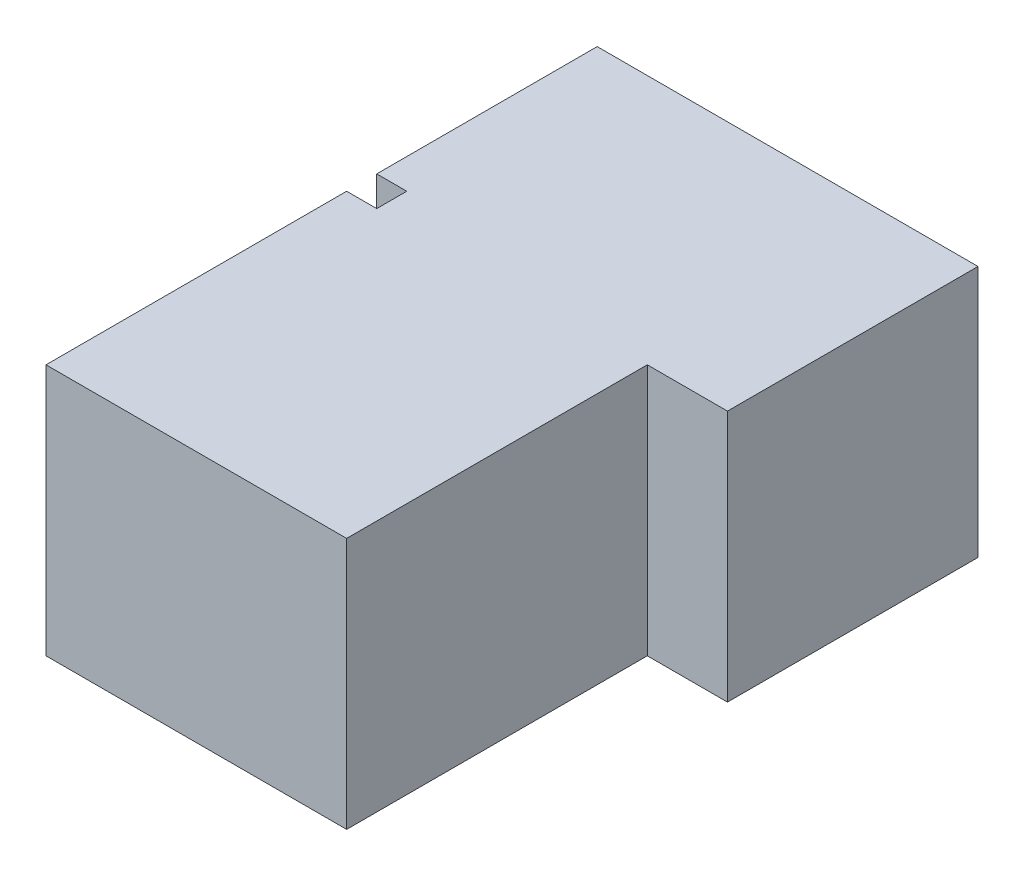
from build123d import *

# Parameters (mm, degrees)
BOSS_EXTRUDE1_DEPTH  = 10
BOSS_EXTRUDE2_DEPTH  = 2500
SKETCH5_W            = 820
SKETCH5_H            = 400
SKETCH5_W_2          = 1110
BOSS_EXTRUDE3_DEPTH  = 400
SKETCH7_W            = 450
SKETCH7_H            = 500
BOSS_EXTRUDE4_DEPTH  = 600
BOSS_EXTRUDE5_DEPTH  = 800
SKETCH8_W            = 600
SKETCH8_H            = 500
CUT_EXTRUDE1_DEPTH   = 600
SKETCH9_W            = 602.400982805
SKETCH9_H            = 23.017507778
BOSS_EXTRUDE6_DEPTH  = 200
SKETCH10_W           = 746.896882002
SKETCH10_H           = 1609.222836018
SKETCH10_W_2         = 739.676210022
SKETCH10_H_2         = 570.253488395
BOSS_EXTRUDE8_DEPTH  = 450
SKETCH11_W           = 514.196630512
SKETCH11_H           = 196.994696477
BOSS_EXTRUDE9_DEPTH  = 200
SKETCH12_W           = 148.014126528
SKETCH12_H           = 447.00781928
BOSS_EXTRUDE10_DEPTH = 200
SKETCH13_R           = 30
BOSS_EXTRUDE11_DEPTH = 60
BOSS_EXTRUDE12_DEPTH = 20
SKETCH15_R           = 30
BOSS_EXTRUDE13_DEPTH = 400
BOSS_EXTRUDE15_DEPTH = 20
SKETCH17_W           = 900
SKETCH17_H           = 300
BOSS_EXTRUDE16_DEPTH = 50
BOSS_EXTRUDE17_DEPTH = 900
SKETCH19_W           = 780
SKETCH19_H           = 30
CUT_EXTRUDE2_DEPTH   = 5
SKETCH20_W           = 780
SKETCH20_H           = 100
CUT_EXTRUDE3_DEPTH   = 5
BOSS_EXTRUDE18_DEPTH = 5


with BuildPart() as part:
    # Sketch2 → Boss-Extrude1 (new body)
    with BuildSketch(Plane(origin=(0, 0, 0), x_dir=(1, 0, 0), z_dir=(0, 1, 0))):
        Polygon((0, 0), (3800, 0), (3800, -2500), (3000, -2500), (3000, -5500), (0, -5500), (0, -2500), (300, -2500), (300, -2200), (0, -2200), align=None)
    extrude(amount=BOSS_EXTRUDE1_DEPTH)

    # Sketch3 → Boss-Extrude2 (add)
    with BuildSketch(Plane(origin=(0, 10, 0), x_dir=(1, 0, 0), z_dir=(0, 1, 0))):
        Polygon((0, 0), (0, -2200), (300, -2200), (300, -2500), (0, -2500), (0, -5500), (3000, -5500), (3000, -2500), (3800, -2500), (3800, 0), align=None)
        Polygon((10, -10), (10, -2190), (310, -2190), (310, -2510), (10, -2510), (10, -5490), (2990, -5490), (2990, -2490), (3790, -2490), (3790, -10), align=None, mode=Mode.SUBTRACT)
    extrude(amount=BOSS_EXTRUDE2_DEPTH)

    # Sketch5 → Boss-Extrude3 (add)
    # profile 1 of 3: a face of its own
    with BuildSketch(Plane(origin=(0, 0, 5490), x_dir=(-1, 0, 0), z_dir=(0, 0, -1))):
        Polygon((-2990, 1810), (-2990, 10), (-2090, 10), (-2090, 1600), (-2090, 1810), align=None)
        with Locations((-2540, 1130)):
            Rectangle(SKETCH5_W, SKETCH5_H, mode=Mode.SUBTRACT)
        with Locations((-2540, 1570)):
            Rectangle(SKETCH5_W, SKETCH5_H, mode=Mode.SUBTRACT)
    # profile 2 of 3: a face of its own
    with BuildSketch(Plane(origin=(0, 0, 5490), x_dir=(-1, 0, 0), z_dir=(0, 0, -1))):
        Polygon((-2090, 1600), (-2090, 10), (-2090, 0), (-900, 0), (-900, 1600), align=None)
        with Locations((-1495, 920)):
            Rectangle(SKETCH5_W_2, SKETCH5_H, mode=Mode.SUBTRACT)
        with Locations((-1495, 1360)):
            Rectangle(SKETCH5_W_2, SKETCH5_H, mode=Mode.SUBTRACT)
    # profile 3 of 3: a face of its own
    with BuildSketch(Plane(origin=(0, 0, 5490), x_dir=(-1, 0, 0), z_dir=(0, 0, -1))):
        Polygon((-900, 1810), (-900, 1600), (-900, 0), (0, 0), (0, 1810), align=None)
        with Locations((-450, 1130)):
            Rectangle(SKETCH5_W, SKETCH5_H, mode=Mode.SUBTRACT)
        with Locations((-450, 1570)):
            Rectangle(SKETCH5_W, SKETCH5_H, mode=Mode.SUBTRACT)
    extrude(amount=BOSS_EXTRUDE3_DEPTH)

    # Sketch7 → Boss-Extrude4 (add)
    with BuildSketch(Plane(origin=(0, 10, 0), x_dir=(1, 0, 0), z_dir=(0, 1, 0))):
        with Locations((1991.820584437, -2845.948463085)):
            Rectangle(SKETCH7_W, SKETCH7_H)
        with Locations((541.820584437, -2845.948463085)):
            Rectangle(SKETCH7_W, SKETCH7_H)
    extrude(amount=BOSS_EXTRUDE4_DEPTH)

    # Sketch7_3 → Boss-Extrude5 (add)
    with BuildSketch(Plane(origin=(0, 10, 0), x_dir=(1, 0, 0), z_dir=(0, 1, 0))):
        Polygon((766.820584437, -2595.948463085), (766.820584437, -3095.948463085), (766.820584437, -3195.948463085), (1766.820584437, -3195.948463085), (1766.820584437, -3095.948463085), (1766.820584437, -2595.948463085), align=None)
    extrude(amount=BOSS_EXTRUDE5_DEPTH)

    # Sketch8 → Cut-Extrude1 (cut)
    with BuildSketch(Plane(origin=(0, 0, 2595.948463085), x_dir=(-1, 0, 0), z_dir=(0, 0, -1))):
        with Locations((-1084.820584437, 260)):
            Rectangle(SKETCH8_W, SKETCH8_H)
    extrude(amount=-CUT_EXTRUDE1_DEPTH, mode=Mode.SUBTRACT)

    # Sketch9 → Boss-Extrude6 (add)
    with BuildSketch(Plane.XZ.offset(-510)):
        with Locations((1086.02107584, 2607.457216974)):
            Rectangle(SKETCH9_W, SKETCH9_H)
    extrude(amount=BOSS_EXTRUDE6_DEPTH)

    # Sketch10 → Boss-Extrude8 (add)
    with BuildSketch(Plane(origin=(0, 10, 0), x_dir=(1, 0, 0), z_dir=(0, 1, 0))):
        with Locations((383.448441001, -1318.346580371)):
            Rectangle(SKETCH10_W, SKETCH10_H)
        with Locations((1208.95408985, -295.126744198)):
            Rectangle(SKETCH10_W_2, SKETCH10_H_2)
    extrude(amount=BOSS_EXTRUDE8_DEPTH)

    # Sketch11 → Boss-Extrude9 (add)
    with BuildSketch(Plane(origin=(0, 460, 0), x_dir=(1, 0, 0), z_dir=(0, 1, 0))):
        Polygon((756.896882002, -687.398138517), (756.896882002, -513.735162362), (10, -513.735162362), (10, -687.398138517), (242.70025149, -687.398138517), align=None)
        Polygon((242.70025149, -687.398138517), (10, -687.398138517), (10, -2122.95799838), (242.70025149, -2122.95799838), (242.70025149, -1925.963301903), align=None)
        with Locations((499.798566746, -2024.460650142)):
            Rectangle(SKETCH11_W, SKETCH11_H)
    extrude(amount=BOSS_EXTRUDE9_DEPTH)

    # Sketch12 → Boss-Extrude10 (add)
    with BuildSketch(Plane(origin=(0, 460, 0), x_dir=(1, 0, 0), z_dir=(0, 1, 0))):
        Polygon((1447.476280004, -580.253488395), (1578.792194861, -580.253488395), (1578.792194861, -10), (1447.476280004, -10), (1447.476280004, -133.245669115), align=None)
        Polygon((987.130111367, -133.245669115), (1447.476280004, -133.245669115), (1447.476280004, -10), (839.115984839, -10), (839.115984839, -133.245669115), align=None)
        with Locations((913.123048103, -356.749578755)):
            Rectangle(SKETCH12_W, SKETCH12_H)
    extrude(amount=BOSS_EXTRUDE10_DEPTH)

    # Sketch13 → Boss-Extrude11 (add)
    with BuildSketch(Plane(origin=(0, 10, 0), x_dir=(1, 0, 0), z_dir=(0, 1, 0))):
        with Locations(Location((1023.376520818, -938.398137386, 0), (0, 0, 90))):
            Circle(SKETCH13_R)
        with Locations(Location((1023.376520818, -1848.884066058, 0), (0, 0, 90))):
            Circle(SKETCH13_R)
        with Locations(Location((1577.951956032, -1848.884066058, 0), (0, 0, 90))):
            Circle(SKETCH13_R)
        with Locations(Location((1577.951956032, -938.398137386, 0), (0, 0, 90))):
            Circle(SKETCH13_R)
    extrude(amount=BOSS_EXTRUDE11_DEPTH)

    # Sketch14 → Boss-Extrude12 (add)
    with BuildSketch(Plane(origin=(0, 70, 0), x_dir=(1, 0, 0), z_dir=(0, 1, 0))):
        with BuildLine():
            Line((1711.664180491, -1126.274116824), (1711.664180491, -1730.974162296))
            ThreePointArc((1711.664180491, -1730.974162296), (1311.861904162, -2130.776438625), (912.059627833, -1730.974162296))
            Line((912.059627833, -1730.974162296), (912.059627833, -1126.274116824))
            ThreePointArc((912.059627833, -1126.274116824), (1311.861904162, -726.471840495), (1711.664180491, -1126.274116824))
        make_face()
    extrude(amount=BOSS_EXTRUDE12_DEPTH)

    # Sketch15 → Boss-Extrude13 (add)
    with BuildSketch(Plane(origin=(0, 90, 0), x_dir=(1, 0, 0), z_dir=(0, 1, 0))):
        with Locations(Location((1550.946378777, -933.22620476, 0), (0, 0, 270))):
            Circle(SKETCH15_R)
        with Locations(Location((1081.064467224, -933.22620476, 0), (0, 0, 270))):
            Circle(SKETCH15_R)
        with Locations(Location((1081.064467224, -1889.029237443, 0), (0, 0, 270))):
            Circle(SKETCH15_R)
        with Locations(Location((1550.946378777, -1889.029237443, 0), (0, 0, 270))):
            Circle(SKETCH15_R)
    extrude(amount=BOSS_EXTRUDE13_DEPTH)

    # Sketch16 → Boss-Extrude15 (add)
    with BuildSketch(Plane(origin=(0, 490, 0), x_dir=(1, 0, 0), z_dir=(0, 1, 0))):
        with BuildLine():
            Line((1007.960277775, -1732.556831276), (1007.960277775, -1003.493484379))
            ThreePointArc((1007.960277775, -1003.493484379), (1354.423992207, -657.029769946), (1700.887706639, -1003.493484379))
            Line((1700.887706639, -1003.493484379), (1700.887706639, -1732.556831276))
            ThreePointArc((1700.887706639, -1732.556831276), (1354.423992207, -2079.020545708), (1007.960277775, -1732.556831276))
        make_face()
    extrude(amount=BOSS_EXTRUDE15_DEPTH)


with BuildPart() as body_2:
    # Sketch17 → Boss-Extrude16 (new body)
    with BuildSketch(Plane.XY.offset(10)):
        with Locations((1940, 2060)):
            Rectangle(SKETCH17_W, SKETCH17_H)
    extrude(amount=BOSS_EXTRUDE16_DEPTH)

    # Sketch18 → Boss-Extrude17 (add)
    with BuildSketch(Plane.ZY.offset(-1490)):
        Polygon((60, 1910), (130, 1910), (230, 2010), (230, 2210), (60, 2210), align=None)
    extrude(amount=-BOSS_EXTRUDE17_DEPTH)

    # Sketch19 → Cut-Extrude2 (cut)
    with BuildSketch(Plane(origin=(0, 890, -890), x_dir=(1, 0, 0), z_dir=(0, -0.7071067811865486, 0.7071067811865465))):
        with Locations((1940, 1543.208511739)):
            Rectangle(SKETCH19_W, SKETCH19_H)
        with Locations((1940, 1483.208511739)):
            Rectangle(SKETCH19_W, SKETCH19_H)
    extrude(amount=-CUT_EXTRUDE2_DEPTH, mode=Mode.SUBTRACT)

    # Sketch20 → Cut-Extrude3 (cut)
    with BuildSketch(Plane(origin=(0, 2210, 0), x_dir=(1, 0, 0), z_dir=(0, 1, 0))):
        with Locations((1940, -120)):
            Rectangle(SKETCH20_W, SKETCH20_H)
    extrude(amount=-CUT_EXTRUDE3_DEPTH, mode=Mode.SUBTRACT)

    # Combine1: union part
    add(part.part)

    # Sketch21 → Boss-Extrude18 (add)
    with BuildSketch(Plane(origin=(0, 2510, 0), x_dir=(1, 0, 0), z_dir=(0, 1, 0))):
        Polygon((3800, 0), (0, 0), (0, -2200), (300, -2200), (300, -2500), (0, -2500), (0, -5500), (3000, -5500), (3000, -2500), (3800, -2500), align=None)
    extrude(amount=BOSS_EXTRUDE18_DEPTH)


solid = body_2.part
